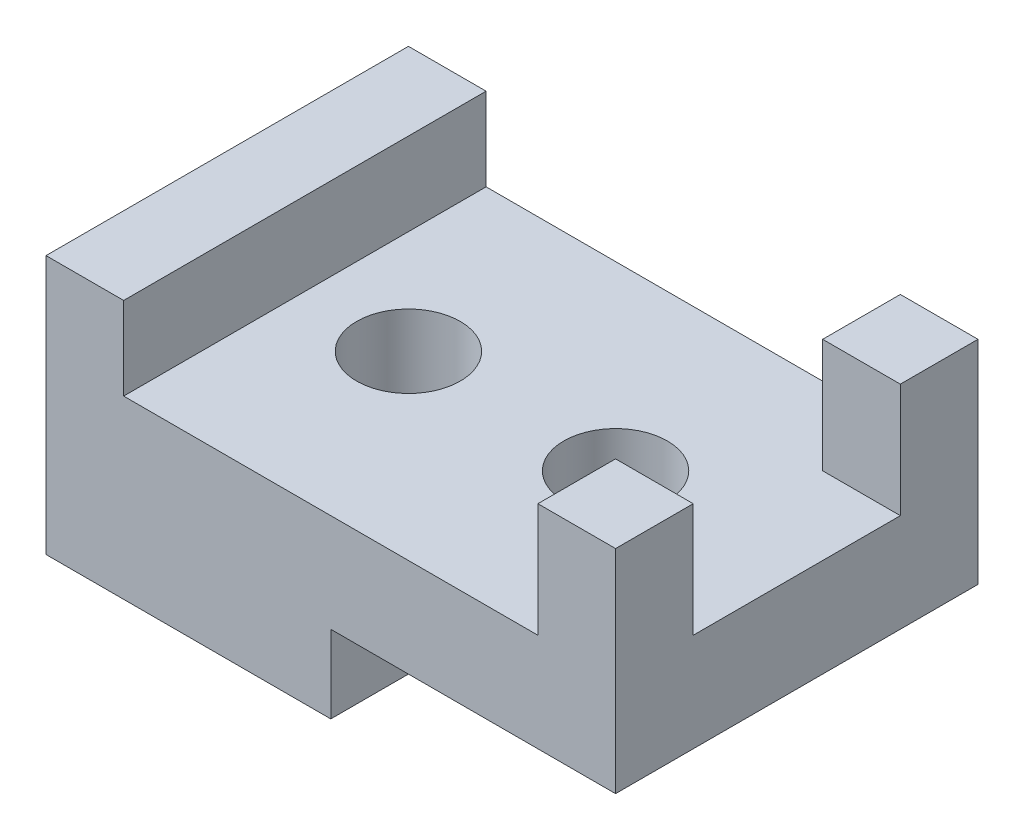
from build123d import *

# Parameters (mm, degrees)
RESSALTO_EXTRUS_O1_DEPTH = 70
ESBO_O2_W                = 15
ESBO_O2_H                = 15
RESSALTO_EXTRUS_O2_DEPTH = 22
ESBO_O3_R                = 10
CORTE_EXTRUS_O1_DEPTH    = 10
ESBO_O3_4_R              = 10
CORTE_EXTRUS_O2_DEPTH    = 20


with BuildPart() as part:
    # Esbo_o1 → Ressalto-extrus_o1 (new body)
    with BuildSketch(Plane.XY):
        Polygon((0, 0), (0, -50), (55, -50), (55, -35), (110, -35), (110, -16), (15, -16), (15, 0), align=None)
    extrude(amount=RESSALTO_EXTRUS_O1_DEPTH)

    # Esbo_o2 → Ressalto-extrus_o2 (add)
    with BuildSketch(Plane(origin=(0, -16, 0), x_dir=(1, 0, 0), z_dir=(0, 1, 0))):
        with Locations((102.5, -62.5)):
            Rectangle(ESBO_O2_W, ESBO_O2_H)
        with Locations((102.5, -7.5)):
            Rectangle(ESBO_O2_W, ESBO_O2_H)
    extrude(amount=RESSALTO_EXTRUS_O2_DEPTH)

    # Esbo_o3 → Corte-extrus_o1 (cut)
    with BuildSketch(Plane(origin=(0, -16, 0), x_dir=(1, 0, 0), z_dir=(0, 1, 0))):
        with Locations(Location((35, -35, 0), (0, 0, 180))):
            Circle(ESBO_O3_R)
    extrude(amount=-CORTE_EXTRUS_O1_DEPTH, mode=Mode.SUBTRACT)

    # Esbo_o3_4 → Corte-extrus_o2 (cut)
    with BuildSketch(Plane(origin=(0, -16, 0), x_dir=(1, 0, 0), z_dir=(0, 1, 0))):
        with Locations(Location((35, -35, 0), (0, 0, 180))):
            Circle(ESBO_O3_4_R)
        with Locations(Location((75, -35, 0), (0, 0, 180))):
            Circle(ESBO_O3_4_R)
    extrude(amount=-CORTE_EXTRUS_O2_DEPTH, mode=Mode.SUBTRACT)


solid = part.part
